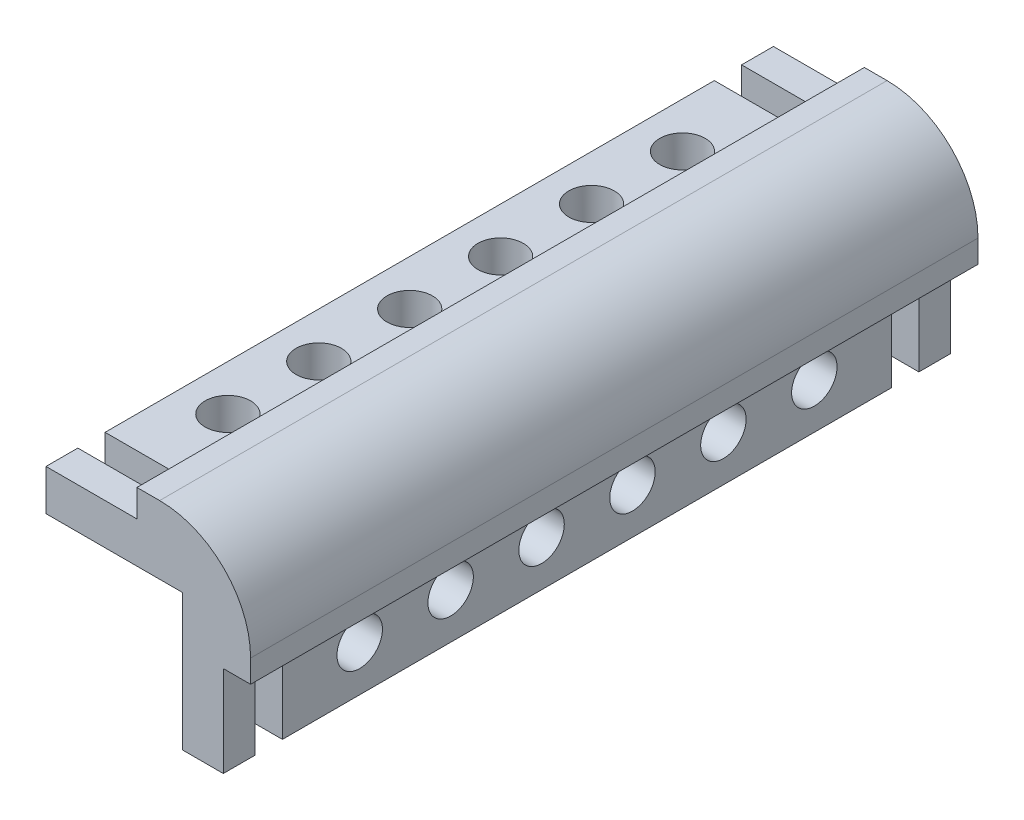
from build123d import *

# Parameters (mm, degrees)
EXTRUDE_THIN1_DEPTH                 = 80
FILLET1_R                           = 20
CUT_EXTRUDE1_DEPTH                  = 169.893457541
CUT_EXTRUDE1_DEPTH_BACK             = 169.893457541
SKETCH2_W                           = 6
SKETCH2_H                           = 20
SKETCH2_W_2                         = 20
SKETCH2_H_2                         = 6
SKETCH3_R                           = 5
CUT_EXTRUDE2_DEPTH                  = 10
SKETCH4_R                           = 5
CUT_EXTRUDE3_DEPTH                  = 10
CUT_EXTRUDE_THIN1_REACH             = 104.225
SKETCH6_W                           = 39
SKETCH6_H                           = 6
CUT_EXTRUDE_THIN1_DIRECTION_2_DEPTH = 103.225241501


with BuildPart() as part:
    # Sketch1 → Extrude-Thin1 (new, symmetric)
    with BuildSketch(Plane.XY):
        Polygon((0, 0), (30, 0), (30, -30), (45, -30), (45, 15), (0, 15), align=None)
    extrude(amount=EXTRUDE_THIN1_DEPTH, both=True)

    # Fillet1
    fillet1_edges = [part.edges().sort_by_distance(p)[0] for p in [
        (45, 15, 0),
    ]]
    fillet(fillet1_edges, radius=FILLET1_R)

    # Sketch2 → Cut-Extrude1 (cut, two sides: drawn at the far end of the back side and taken through both)
    with BuildSketch(Plane.XY.offset(80).offset(-CUT_EXTRUDE1_DEPTH_BACK)):
        with Locations((42, -20)):
            Rectangle(SKETCH2_W, SKETCH2_H)
        with Locations((10, 12)):
            Rectangle(SKETCH2_W_2, SKETCH2_H_2)
    extrude(amount=CUT_EXTRUDE1_DEPTH + CUT_EXTRUDE1_DEPTH_BACK, mode=Mode.SUBTRACT)

    # Sketch3 → Cut-Extrude2 (cut)
    with BuildSketch(Plane(origin=(39, 0, 0), x_dir=(0, 0, -1), z_dir=(1, 0, 0))):
        with Locations(Location((50, -20, 0), (0, 0, 90))):
            Circle(SKETCH3_R)
        with Locations(Location((30, -20, 0), (0, 0, 90))):
            Circle(SKETCH3_R)
        with Locations(Location((-30, -20, 0), (0, 0, 90))):
            Circle(SKETCH3_R)
        with Locations(Location((-50, -20, 0), (0, 0, 90))):
            Circle(SKETCH3_R)
        with Locations(Location((10, -20, 0), (0, 0, 90))):
            Circle(SKETCH3_R)
        with Locations(Location((-10, -20, 0), (0, 0, 90))):
            Circle(SKETCH3_R)
    extrude(amount=-CUT_EXTRUDE2_DEPTH, mode=Mode.SUBTRACT)

    # Sketch4 → Cut-Extrude3 (cut)
    with BuildSketch(Plane(origin=(0, 9, 0), x_dir=(1, 0, 0), z_dir=(0, 1, 0))):
        with Locations(Location((10, -50, 0), (0, 0, 270))):
            Circle(SKETCH4_R)
        with Locations(Location((10, -30, 0), (0, 0, 270))):
            Circle(SKETCH4_R)
        with Locations(Location((10, -10, 0), (0, 0, 270))):
            Circle(SKETCH4_R)
        with Locations(Location((10, 10, 0), (0, 0, 270))):
            Circle(SKETCH4_R)
        with Locations(Location((10, 30, 0), (0, 0, 270))):
            Circle(SKETCH4_R)
        with Locations(Location((10, 50, 0), (0, 0, 270))):
            Circle(SKETCH4_R)
    extrude(amount=-CUT_EXTRUDE3_DEPTH, mode=Mode.SUBTRACT)

    # Cut-Extrude-Thin1: up to this face of the body (flat: up to its plane)
    cut_extrude_thin1_end = Plane(part.part.faces().sort_by_distance((10, 9, 0))[0])
    # Sketch6 → Cut-Extrude-Thin1 (cut, up to the picked face)
    with BuildSketch(Plane.XZ.offset(30), mode=Mode.PRIVATE) as cut_extrude_thin1_sk1:
        with Locations((19.5, 70)):
            Rectangle(SKETCH6_W, SKETCH6_H)
    cut_extrude_thin1_tool1 = split(extrude(cut_extrude_thin1_sk1.sketch, amount=-CUT_EXTRUDE_THIN1_REACH, mode=Mode.PRIVATE), bisect_by=cut_extrude_thin1_end, keep=Keep.BOTH, mode=Mode.PRIVATE)
    cut_extrude_thin1 = cut_extrude_thin1_tool1.solids().sort_by(Axis((19.5, -30, 70), (0, 1, 0)))[0]
    add(cut_extrude_thin1, mode=Mode.SUBTRACT)

    # Sketch6 → Cut-Extrude-Thin1 direction 2 (cut)
    with BuildSketch(Plane.XZ.offset(30)):
        with Locations((19.5, 70)):
            Rectangle(SKETCH6_W, SKETCH6_H)
    cut_extrude_thin1_direction_2 = extrude(amount=CUT_EXTRUDE_THIN1_DIRECTION_2_DEPTH, mode=Mode.SUBTRACT)

    # Mirror1: Cut-Extrude-Thin1, Cut-Extrude-Thin1 direction 2 across plane
    add(cut_extrude_thin1.mirror(Plane.XY), mode=Mode.SUBTRACT)
    add(cut_extrude_thin1_direction_2.mirror(Plane.XY), mode=Mode.SUBTRACT)


solid = part.part
